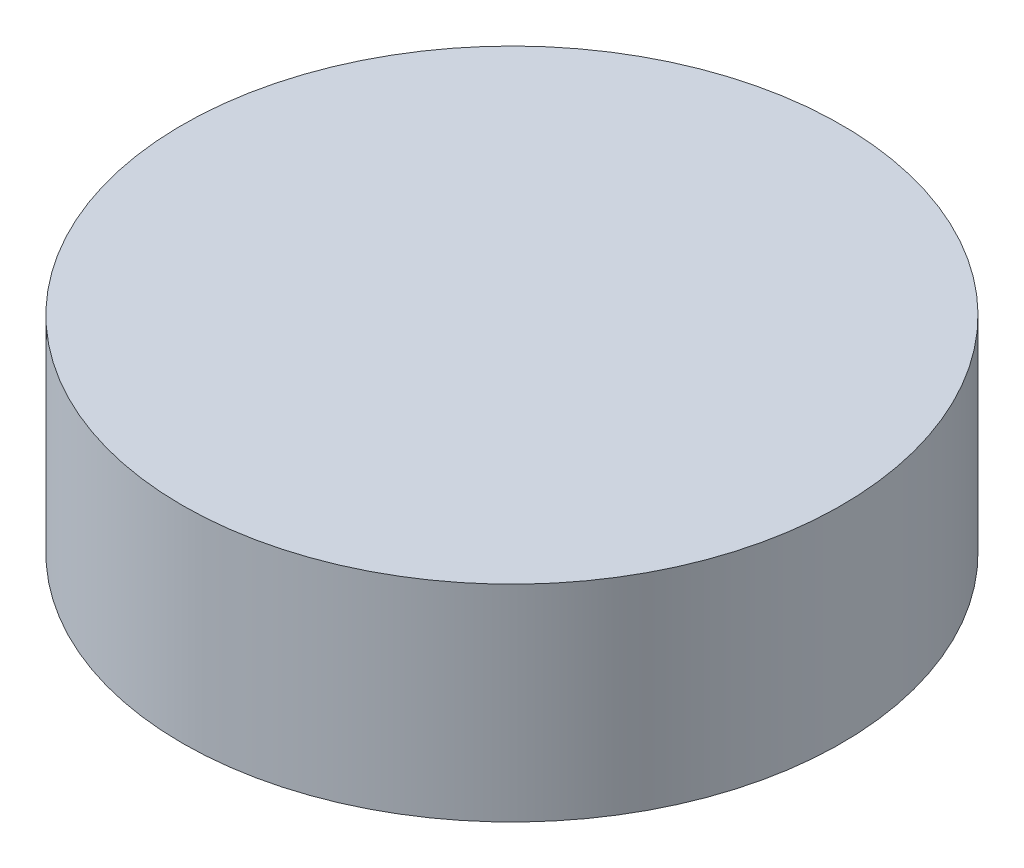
from build123d import *

# Parameters (mm, degrees)
CROQUIS1_R              = 40
SALIENTE_EXTRUIR1_DEPTH = 25


with BuildPart() as part:
    # Croquis1 → Saliente-Extruir1 (new body)
    with BuildSketch(Plane(origin=(0, 0, 0), x_dir=(1, 0, 0), z_dir=(0, 1, 0))):
        with Locations(Location((0, 0, 0), (0, 0, 270))):
            Circle(CROQUIS1_R)
    extrude(amount=SALIENTE_EXTRUIR1_DEPTH)


solid = part.part
